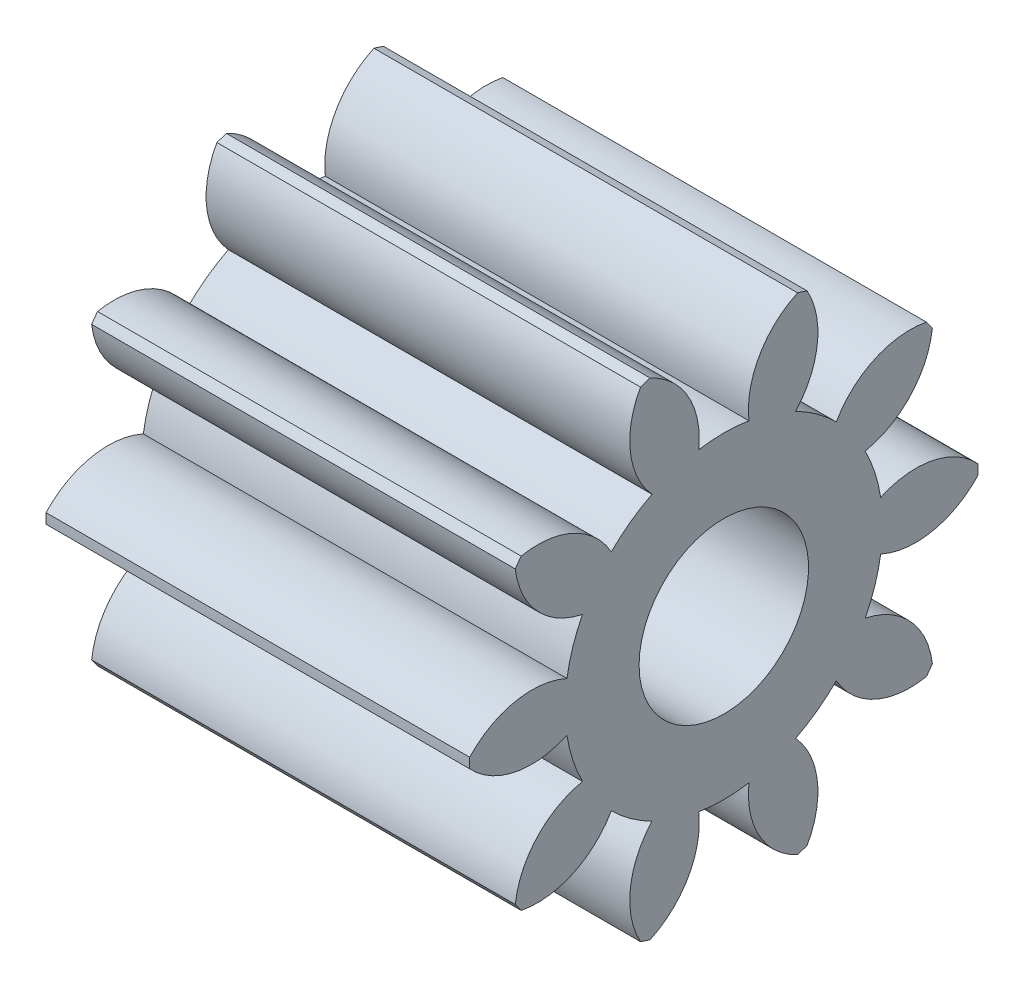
from build123d import *

# Parameters (mm, degrees)
BASPROSKE_W     = 5
BASPROSKE_H     = 3
TOOTHCUT_DEPTH  = 7.557438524
TEETHCUTS_COUNT = 10
BORSKE_R        = 1
BORE_DEPTH      = 5.0000508


with BuildPart() as part:
    # BasProSke → Base-Revolve (revolve)
    with BuildSketch(Plane(origin=(0, 0, 0), x_dir=(1, 0, 0), z_dir=(0, 1, 0)), mode=Mode.PRIVATE) as base_revolve_sk:
        with Locations((2.5, 1.5)):
            Rectangle(BASPROSKE_W, BASPROSKE_H)
    revolve(base_revolve_sk.sketch.rotate(Axis((-10, 0, 0), (1, 0, 0)), 180), axis=Axis((-10, 0, 0), (1, 0, 0)))

    # TooCutSke → ToothCut (cut, through all)
    with BuildSketch(Plane(origin=(0, 0, 0), x_dir=(0, 0, -1), z_dir=(1, 0, 0))):
        with BuildLine():
            ThreePointArc((0.296449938, 1.850403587), (0, 1.874), (-0.296449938, 1.850403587))
            ThreePointArc((-0.296449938, 1.850403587), (-0.428089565, 2.470295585), (-0.905889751, 2.886591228))
            ThreePointArc((-0.905889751, 2.886591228), (0, 3.0254), (0.905889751, 2.886591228))
            ThreePointArc((0.905889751, 2.886591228), (0.428089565, 2.470295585), (0.296449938, 1.850403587))
        make_face()
    toothcut = extrude(amount=TOOTHCUT_DEPTH, mode=Mode.SUBTRACT)

    # TeethCuts: ToothCut ×10 about axis
    teethcuts_axis = Axis((0, 0, 0), (1, 0, 0))
    for i in range(1, TEETHCUTS_COUNT):
        add(toothcut.rotate(teethcuts_axis, i * 360 / TEETHCUTS_COUNT), mode=Mode.SUBTRACT)

    # BorSke → Bore (cut, symmetric)
    with BuildSketch(Plane(origin=(0, 0, 0), x_dir=(0, 0, -1), z_dir=(1, 0, 0))):
        with Locations(Location((0, 0, 0), (0, 0, 180))):
            Circle(BORSKE_R)
    extrude(amount=BORE_DEPTH, both=True, mode=Mode.SUBTRACT)


solid = part.part
